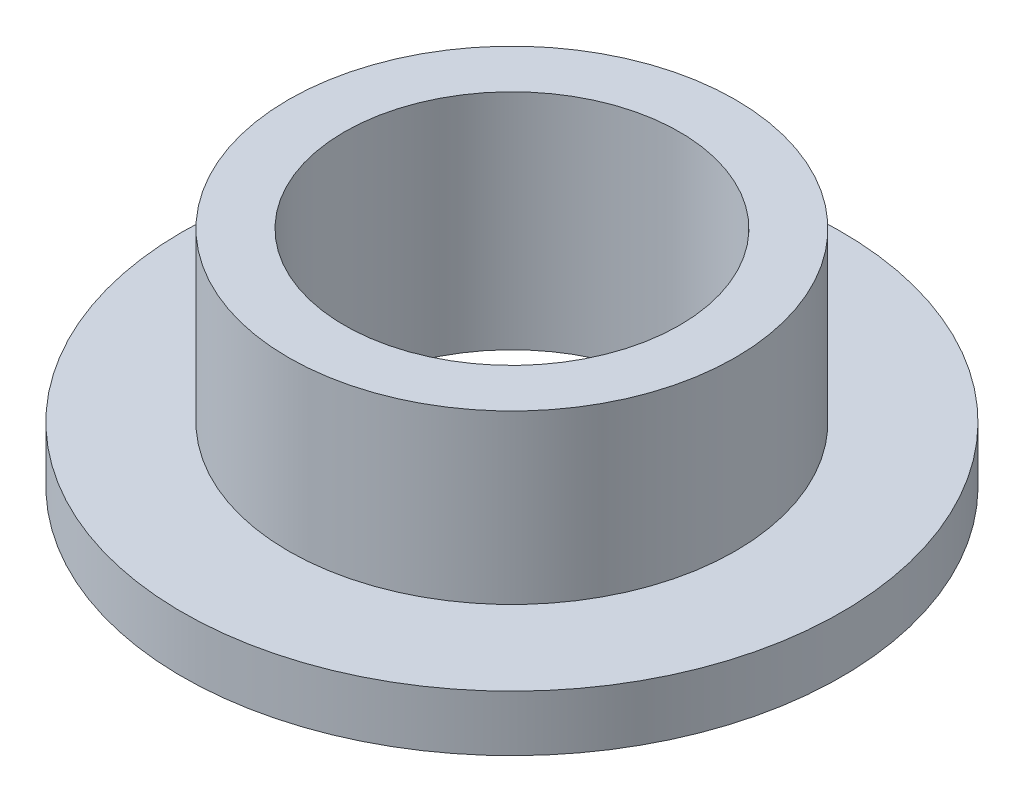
from build123d import *


with BuildPart() as part:
    # Sketch1 → Revolve1 (revolve)
    with BuildSketch(Plane.XY, mode=Mode.PRIVATE) as revolve1_sk:
        Polygon((2, 0), (2.95, 0), (2.95, -0.5), (1.5, -0.5), (1.5, 1.5), (2, 1.5), align=None)
    revolve(revolve1_sk.sketch.rotate(Axis((0, 25.272286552, 0), (0, -1, 0)), 180), axis=Axis((0, 25.272286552, 0), (0, -1, 0)))


solid = part.part
